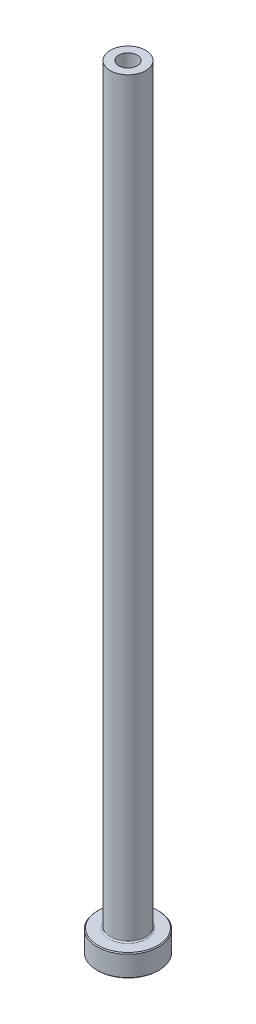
from build123d import *

# Parameters (mm, degrees)
FILLET1_R     = 0.3
CHAMFER1_SIZE = 0.2
CHAMFER3_SIZE = 0.5


with BuildPart() as part:
    # Sketch1 → Revolve1 (revolve)
    with BuildSketch(Plane.XY, mode=Mode.PRIVATE) as revolve1_sk:
        Polygon((-2.1, 175), (-4, 175), (-4, 5), (-7, 5), (-7, 0), (-2.35, 0), (-2.35, 118), (-2.1, 130), align=None)
    revolve(revolve1_sk.sketch.rotate(Axis((0, 92.187680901, 0), (0, -1, 0)), 270), axis=Axis((0, 92.187680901, 0), (0, -1, 0)))

    # Fillet1
    fillet1_edges = [part.edges().sort_by_distance(p)[0] for p in [
        (0, 5, -4),
    ]]
    fillet(fillet1_edges, radius=FILLET1_R)

    # Chamfer1
    chamfer1_edges = [part.edges().sort_by_distance(p)[0] for p in [
        (0, 0, -7),
        (0, 5, -7),
    ]]
    chamfer(chamfer1_edges, length=CHAMFER1_SIZE)

    # Chamfer3
    chamfer3_edges = [part.edges().sort_by_distance(p)[0] for p in [
        (0, 0, -2.35),
    ]]
    chamfer(chamfer3_edges, length=CHAMFER3_SIZE)


solid = part.part
